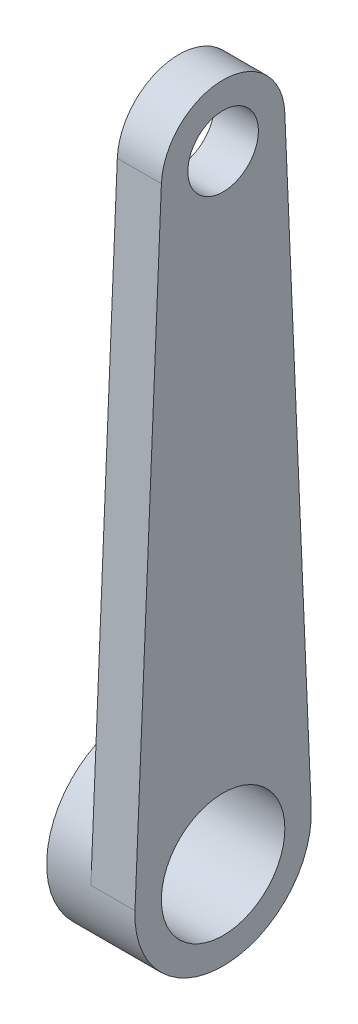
from build123d import *

# Parameters (mm, degrees)
SKETCH1_R           = 10
SKETCH1_R_2         = 17.5
BOSS_EXTRUDE1_DEPTH = 12.5
BOSS_EXTRUDE5_START = -12.5
SKETCH1_6_R         = 17.5
BOSS_EXTRUDE5_DEPTH = 12.5


with BuildPart() as part:
    # Sketch1 → Boss-Extrude1 (new body)
    with BuildSketch(Plane(origin=(0, 0, 0), x_dir=(0, 0, -1), z_dir=(1, 0, 0))):
        with BuildLine():
            Line((-17.483921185, 0.75), (-24.977030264, -173.928571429))
            ThreePointArc((-24.977030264, -173.928571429), (0, -200), (24.977030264, -173.928571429))
            Line((24.977030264, -173.928571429), (17.483921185, 0.75))
            ThreePointArc((17.483921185, 0.75), (0, 17.5), (-17.483921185, 0.75))
        make_face()
        Circle(SKETCH1_R, mode=Mode.SUBTRACT)
        with Locations((0, -175)):
            Circle(SKETCH1_R_2, mode=Mode.SUBTRACT)
    extrude(amount=BOSS_EXTRUDE1_DEPTH)

    # Sketch1_6 → Boss-Extrude5 (add)
    with BuildSketch(Plane(origin=(0, 0, 0), x_dir=(0, 0, -1), z_dir=(1, 0, 0)).offset(BOSS_EXTRUDE5_START)):
        with BuildLine():
            ThreePointArc((24.977030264, -173.928571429), (0, -150), (-24.977030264, -173.928571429))
            ThreePointArc((-24.977030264, -173.928571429), (0, -200), (24.977030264, -173.928571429))
        make_face()
        with Locations((0, -175)):
            Circle(SKETCH1_6_R, mode=Mode.SUBTRACT)
    extrude(amount=BOSS_EXTRUDE5_DEPTH)


solid = part.part
